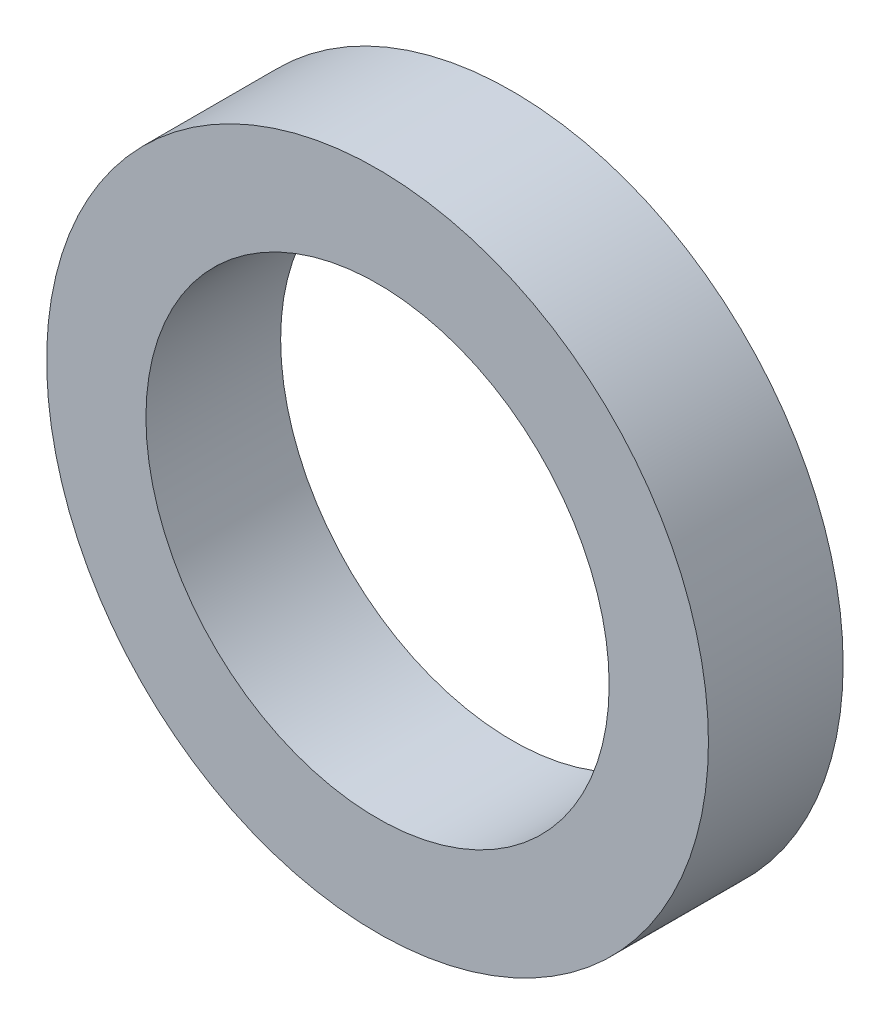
ISO-10303-21;
HEADER;
FILE_DESCRIPTION(('STEP AP214'),'2;1');
FILE_NAME('part.step','',(''),(''),'','','');
FILE_SCHEMA(('AUTOMOTIVE_DESIGN { 1 0 10303 214 1 1 1 1 }'));
ENDSEC;
DATA;
#1=APPLICATION_CONTEXT('core data for automotive mechanical design processes');
#2=APPLICATION_PROTOCOL_DEFINITION('international standard','automotive_design',2000,#1);
#3=PRODUCT_CONTEXT('',#1,'mechanical');
#4=PRODUCT('Part','Part','',(#3));
#5=PRODUCT_RELATED_PRODUCT_CATEGORY('part','',(#4));
#6=PRODUCT_DEFINITION_FORMATION('','',#4);
#7=PRODUCT_DEFINITION_CONTEXT('part definition',#1,'design');
#8=PRODUCT_DEFINITION('design','',#6,#7);
#9=PRODUCT_DEFINITION_SHAPE('','',#8);
#10=(LENGTH_UNIT() NAMED_UNIT(*) SI_UNIT(.MILLI.,.METRE.));
#11=(NAMED_UNIT(*) PLANE_ANGLE_UNIT() SI_UNIT($,.RADIAN.));
#12=(NAMED_UNIT(*) SI_UNIT($,.STERADIAN.) SOLID_ANGLE_UNIT());
#13=UNCERTAINTY_MEASURE_WITH_UNIT(LENGTH_MEASURE(1.E-05),#10,'distance_accuracy_value','');
#14=(GEOMETRIC_REPRESENTATION_CONTEXT(3) GLOBAL_UNCERTAINTY_ASSIGNED_CONTEXT((#13)) GLOBAL_UNIT_ASSIGNED_CONTEXT((#10,
#11,#12)) REPRESENTATION_CONTEXT('',''));
#15=CARTESIAN_POINT('',(0.,0.,0.));
#16=DIRECTION('',(0.,0.,1.));
#17=DIRECTION('',(1.,0.,0.));
#18=AXIS2_PLACEMENT_3D('',#15,#16,#17);
#19=CARTESIAN_POINT('',(0.,0.,2.85));
#20=DIRECTION('',(0.,0.,1.));
#21=DIRECTION('',(1.,0.,0.));
#22=AXIS2_PLACEMENT_3D('',#19,#20,#21);
#23=PLANE('',#22);
#24=CARTESIAN_POINT('',(0.,0.,2.85));
#25=DIRECTION('',(0.,0.,1.));
#26=DIRECTION('',(1.,0.,0.));
#27=AXIS2_PLACEMENT_3D('',#24,#25,#26);
#28=CIRCLE('',#27,7.);
#29=CARTESIAN_POINT('',(7.,0.,2.85));
#30=VERTEX_POINT('',#29);
#31=EDGE_CURVE('E10',#30,#30,#28,.T.);
#32=ORIENTED_EDGE('',*,*,#31,.T.);
#33=EDGE_LOOP('',(#32));
#34=FACE_BOUND('',#33,.T.);
#35=CARTESIAN_POINT('',(0.,0.,2.85));
#36=DIRECTION('',(0.,0.,1.));
#37=DIRECTION('',(1.,0.,0.));
#38=AXIS2_PLACEMENT_3D('',#35,#36,#37);
#39=CIRCLE('',#38,4.9);
#40=CARTESIAN_POINT('',(4.9,0.,2.85));
#41=VERTEX_POINT('',#40);
#42=EDGE_CURVE('E359',#41,#41,#39,.T.);
#43=ORIENTED_EDGE('',*,*,#42,.F.);
#44=EDGE_LOOP('',(#43));
#45=FACE_BOUND('',#44,.T.);
#46=ADVANCED_FACE('F348',(#34,#45),#23,.T.);
#47=CARTESIAN_POINT('',(0.,0.,0.));
#48=DIRECTION('',(0.,0.,1.));
#49=DIRECTION('',(1.,0.,0.));
#50=AXIS2_PLACEMENT_3D('',#47,#48,#49);
#51=PLANE('',#50);
#52=CARTESIAN_POINT('',(0.,0.,0.));
#53=DIRECTION('',(0.,0.,1.));
#54=DIRECTION('',(1.,0.,0.));
#55=AXIS2_PLACEMENT_3D('',#52,#53,#54);
#56=CIRCLE('',#55,7.);
#57=CARTESIAN_POINT('',(7.,0.,0.));
#58=VERTEX_POINT('',#57);
#59=EDGE_CURVE('E355',#58,#58,#56,.T.);
#60=ORIENTED_EDGE('',*,*,#59,.F.);
#61=EDGE_LOOP('',(#60));
#62=FACE_BOUND('',#61,.T.);
#63=CARTESIAN_POINT('',(0.,0.,0.));
#64=DIRECTION('',(0.,0.,1.));
#65=DIRECTION('',(1.,0.,0.));
#66=AXIS2_PLACEMENT_3D('',#63,#64,#65);
#67=CIRCLE('',#66,4.9);
#68=CARTESIAN_POINT('',(4.9,0.,0.));
#69=VERTEX_POINT('',#68);
#70=EDGE_CURVE('E363',#69,#69,#67,.T.);
#71=ORIENTED_EDGE('',*,*,#70,.T.);
#72=EDGE_LOOP('',(#71));
#73=FACE_BOUND('',#72,.T.);
#74=ADVANCED_FACE('F369',(#62,#73),#51,.F.);
#75=CARTESIAN_POINT('',(0.,0.,2.85));
#76=DIRECTION('',(0.,0.,-1.));
#77=DIRECTION('',(-1.,0.,0.));
#78=AXIS2_PLACEMENT_3D('',#75,#76,#77);
#79=CYLINDRICAL_SURFACE('',#78,7.);
#80=ORIENTED_EDGE('',*,*,#31,.F.);
#81=EDGE_LOOP('',(#80));
#82=FACE_BOUND('',#81,.T.);
#83=ORIENTED_EDGE('',*,*,#59,.T.);
#84=EDGE_LOOP('',(#83));
#85=FACE_BOUND('',#84,.T.);
#86=ADVANCED_FACE('F350',(#82,#85),#79,.T.);
#87=CARTESIAN_POINT('',(0.,0.,2.85));
#88=DIRECTION('',(0.,0.,-1.));
#89=DIRECTION('',(-1.,0.,0.));
#90=AXIS2_PLACEMENT_3D('',#87,#88,#89);
#91=CYLINDRICAL_SURFACE('',#90,4.9);
#92=ORIENTED_EDGE('',*,*,#42,.T.);
#93=EDGE_LOOP('',(#92));
#94=FACE_BOUND('',#93,.T.);
#95=ORIENTED_EDGE('',*,*,#70,.F.);
#96=EDGE_LOOP('',(#95));
#97=FACE_BOUND('',#96,.T.);
#98=ADVANCED_FACE('F371',(#94,#97),#91,.F.);
#99=CLOSED_SHELL('',(#46,#74,#86,#98));
#100=MANIFOLD_SOLID_BREP('B2',#99);
#101=ADVANCED_BREP_SHAPE_REPRESENTATION('',(#18,#100),#14);
#102=SHAPE_DEFINITION_REPRESENTATION(#9,#101);
ENDSEC;
END-ISO-10303-21;
